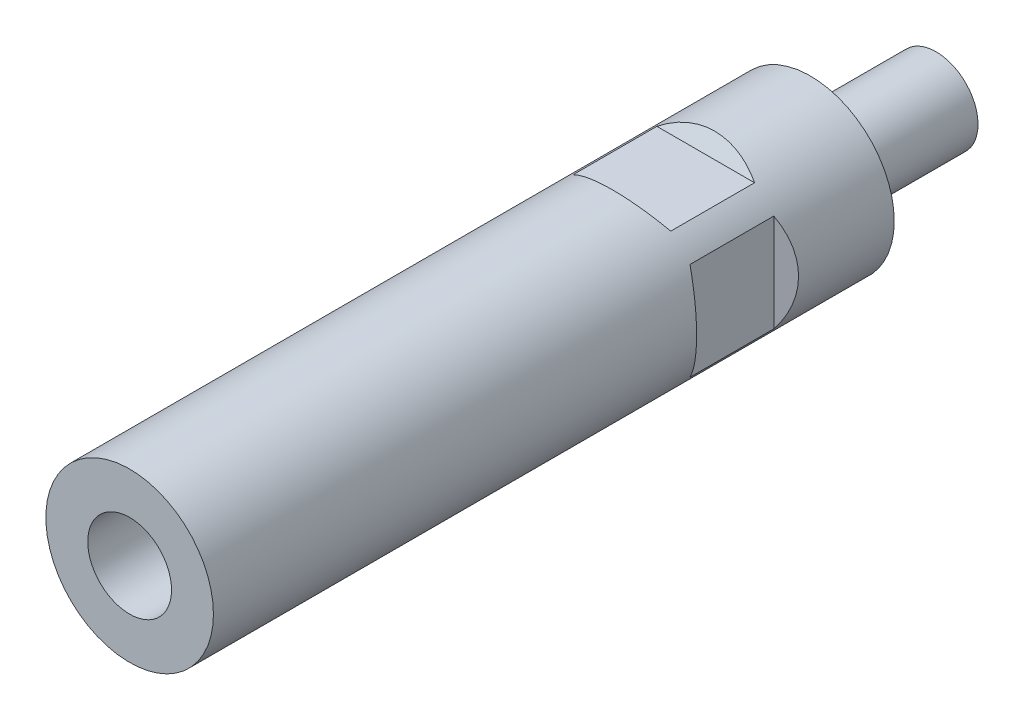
ISO-10303-21;
HEADER;
FILE_DESCRIPTION(('STEP AP214'),'2;1');
FILE_NAME('part.step','',(''),(''),'','','');
FILE_SCHEMA(('AUTOMOTIVE_DESIGN { 1 0 10303 214 1 1 1 1 }'));
ENDSEC;
DATA;
#1=APPLICATION_CONTEXT('core data for automotive mechanical design processes');
#2=APPLICATION_PROTOCOL_DEFINITION('international standard','automotive_design',2000,#1);
#3=PRODUCT_CONTEXT('',#1,'mechanical');
#4=PRODUCT('Part','Part','',(#3));
#5=PRODUCT_RELATED_PRODUCT_CATEGORY('part','',(#4));
#6=PRODUCT_DEFINITION_FORMATION('','',#4);
#7=PRODUCT_DEFINITION_CONTEXT('part definition',#1,'design');
#8=PRODUCT_DEFINITION('design','',#6,#7);
#9=PRODUCT_DEFINITION_SHAPE('','',#8);
#10=(LENGTH_UNIT() NAMED_UNIT(*) SI_UNIT(.MILLI.,.METRE.));
#11=(NAMED_UNIT(*) PLANE_ANGLE_UNIT() SI_UNIT($,.RADIAN.));
#12=(NAMED_UNIT(*) SI_UNIT($,.STERADIAN.) SOLID_ANGLE_UNIT());
#13=UNCERTAINTY_MEASURE_WITH_UNIT(LENGTH_MEASURE(1.E-05),#10,'distance_accuracy_value','');
#14=(GEOMETRIC_REPRESENTATION_CONTEXT(3) GLOBAL_UNCERTAINTY_ASSIGNED_CONTEXT((#13)) GLOBAL_UNIT_ASSIGNED_CONTEXT((#10,
#11,#12)) REPRESENTATION_CONTEXT('',''));
#15=CARTESIAN_POINT('',(0.,0.,0.));
#16=DIRECTION('',(0.,0.,1.));
#17=DIRECTION('',(1.,0.,0.));
#18=AXIS2_PLACEMENT_3D('',#15,#16,#17);
#19=CARTESIAN_POINT('',(0.,0.,8.));
#20=DIRECTION('',(0.,0.,1.));
#21=DIRECTION('',(0.,-1.,0.));
#22=AXIS2_PLACEMENT_3D('',#19,#20,#21);
#23=CYLINDRICAL_SURFACE('',#22,4.);
#24=CARTESIAN_POINT('',(0.,0.,-12.));
#25=DIRECTION('',(0.,0.,1.));
#26=DIRECTION('',(0.,-1.,0.));
#27=AXIS2_PLACEMENT_3D('',#24,#25,#26);
#28=CIRCLE('',#27,4.);
#29=CARTESIAN_POINT('',(0.,-4.,-12.));
#30=VERTEX_POINT('',#29);
#31=EDGE_CURVE('E22',#30,#30,#28,.F.);
#32=ORIENTED_EDGE('',*,*,#31,.F.);
#33=EDGE_LOOP('',(#32));
#34=FACE_BOUND('',#33,.T.);
#35=CARTESIAN_POINT('',(0.,0.,0.));
#36=DIRECTION('',(0.,0.,1.));
#37=DIRECTION('',(1.,0.,0.));
#38=AXIS2_PLACEMENT_3D('',#35,#36,#37);
#39=CIRCLE('',#38,4.);
#40=CARTESIAN_POINT('',(4.,0.,0.));
#41=VERTEX_POINT('',#40);
#42=EDGE_CURVE('E9',#41,#41,#39,.T.);
#43=ORIENTED_EDGE('',*,*,#42,.F.);
#44=EDGE_LOOP('',(#43));
#45=FACE_BOUND('',#44,.T.);
#46=ADVANCED_FACE('F14',(#34,#45),#23,.T.);
#47=CARTESIAN_POINT('',(0.,0.,-12.));
#48=DIRECTION('',(0.,0.,1.));
#49=DIRECTION('',(0.,-1.,0.));
#50=AXIS2_PLACEMENT_3D('',#47,#48,#49);
#51=PLANE('',#50);
#52=ORIENTED_EDGE('',*,*,#31,.T.);
#53=EDGE_LOOP('',(#52));
#54=FACE_BOUND('',#53,.T.);
#55=ADVANCED_FACE('F16',(#54),#51,.F.);
#56=CARTESIAN_POINT('',(3.4,0.,45.));
#57=DIRECTION('',(0.,0.,-1.));
#58=DIRECTION('',(-1.,0.,0.));
#59=AXIS2_PLACEMENT_3D('',#56,#57,#58);
#60=PLANE('',#59);
#61=CARTESIAN_POINT('',(0.,0.,45.));
#62=DIRECTION('',(0.,0.,1.));
#63=DIRECTION('',(1.,0.,0.));
#64=AXIS2_PLACEMENT_3D('',#61,#62,#63);
#65=CIRCLE('',#64,4.);
#66=CARTESIAN_POINT('',(4.,0.,45.));
#67=VERTEX_POINT('',#66);
#68=EDGE_CURVE('E251',#67,#67,#65,.T.);
#69=ORIENTED_EDGE('',*,*,#68,.T.);
#70=EDGE_LOOP('',(#69));
#71=FACE_BOUND('',#70,.T.);
#72=ADVANCED_FACE('F125',(#71),#60,.F.);
#73=CARTESIAN_POINT('',(0.,0.,65.));
#74=DIRECTION('',(0.,0.,1.));
#75=DIRECTION('',(1.,0.,0.));
#76=AXIS2_PLACEMENT_3D('',#73,#74,#75);
#77=CYLINDRICAL_SURFACE('',#76,4.);
#78=ORIENTED_EDGE('',*,*,#68,.F.);
#79=EDGE_LOOP('',(#78));
#80=FACE_BOUND('',#79,.T.);
#81=CARTESIAN_POINT('',(0.,0.,65.));
#82=DIRECTION('',(0.,0.,1.));
#83=DIRECTION('',(1.,0.,0.));
#84=AXIS2_PLACEMENT_3D('',#81,#82,#83);
#85=CIRCLE('',#84,4.);
#86=CARTESIAN_POINT('',(4.,0.,65.));
#87=VERTEX_POINT('',#86);
#88=EDGE_CURVE('E96',#87,#87,#85,.T.);
#89=ORIENTED_EDGE('',*,*,#88,.T.);
#90=EDGE_LOOP('',(#89));
#91=FACE_BOUND('',#90,.T.);
#92=ADVANCED_FACE('F127',(#80,#91),#77,.F.);
#93=CARTESIAN_POINT('',(0.,0.,65.));
#94=DIRECTION('',(0.,0.,1.));
#95=DIRECTION('',(1.,0.,0.));
#96=AXIS2_PLACEMENT_3D('',#93,#94,#95);
#97=PLANE('',#96);
#98=ORIENTED_EDGE('',*,*,#88,.F.);
#99=EDGE_LOOP('',(#98));
#100=FACE_BOUND('',#99,.T.);
#101=CARTESIAN_POINT('',(0.,0.,65.));
#102=DIRECTION('',(0.,0.,1.));
#103=DIRECTION('',(1.,0.,0.));
#104=AXIS2_PLACEMENT_3D('',#101,#102,#103);
#105=CIRCLE('',#104,8.);
#106=CARTESIAN_POINT('',(8.,0.,65.));
#107=VERTEX_POINT('',#106);
#108=EDGE_CURVE('E239',#107,#107,#105,.T.);
#109=ORIENTED_EDGE('',*,*,#108,.T.);
#110=EDGE_LOOP('',(#109));
#111=FACE_BOUND('',#110,.T.);
#112=ADVANCED_FACE('F134',(#100,#111),#97,.T.);
#113=CARTESIAN_POINT('',(6.5,-8.,18.));
#114=DIRECTION('',(-0.5,0.,0.86602540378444));
#115=DIRECTION('',(0.86602540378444,0.,0.5));
#116=AXIS2_PLACEMENT_3D('',#113,#114,#115);
#117=PLANE('',#116);
#118=DIRECTION('',(0.,1.,0.));
#119=VECTOR('',#118,1.);
#120=CARTESIAN_POINT('',(6.5,-8.,18.));
#121=LINE('',#120,#119);
#122=CARTESIAN_POINT('',(6.5,-4.6636895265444,18.));
#123=VERTEX_POINT('',#122);
#124=CARTESIAN_POINT('',(6.5,4.6636895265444,18.));
#125=VERTEX_POINT('',#124);
#126=EDGE_CURVE('E183',#123,#125,#121,.T.);
#127=ORIENTED_EDGE('',*,*,#126,.T.);
#128=CARTESIAN_POINT('',(0.,0.,14.2472232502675));
#129=DIRECTION('',(-0.5,0.,0.86602540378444));
#130=DIRECTION('',(-0.86602540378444,0.,-0.5));
#131=AXIS2_PLACEMENT_3D('',#128,#129,#130);
#132=ELLIPSE('',#131,9.237604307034,8.);
#133=EDGE_CURVE('E35',#123,#125,#132,.T.);
#134=ORIENTED_EDGE('',*,*,#133,.F.);
#135=EDGE_LOOP('',(#127,#134));
#136=FACE_BOUND('',#135,.T.);
#137=ADVANCED_FACE('F175',(#136),#117,.F.);
#138=CARTESIAN_POINT('',(6.5,-8.,18.));
#139=DIRECTION('',(-1.,0.,0.));
#140=DIRECTION('',(0.,0.,1.));
#141=AXIS2_PLACEMENT_3D('',#138,#139,#140);
#142=PLANE('',#141);
#143=ORIENTED_EDGE('',*,*,#126,.F.);
#144=DIRECTION('',(0.,0.,-1.));
#145=VECTOR('',#144,1.);
#146=CARTESIAN_POINT('',(6.5,-4.6636895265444,65.));
#147=LINE('',#146,#145);
#148=CARTESIAN_POINT('',(6.5,-4.66368952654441,10.));
#149=VERTEX_POINT('',#148);
#150=EDGE_CURVE('E191',#149,#123,#147,.F.);
#151=ORIENTED_EDGE('',*,*,#150,.F.);
#152=DIRECTION('',(0.,1.,0.));
#153=VECTOR('',#152,1.);
#154=CARTESIAN_POINT('',(6.5,-8.,10.));
#155=LINE('',#154,#153);
#156=CARTESIAN_POINT('',(6.5,4.6636895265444,10.));
#157=VERTEX_POINT('',#156);
#158=EDGE_CURVE('E187',#149,#157,#155,.T.);
#159=ORIENTED_EDGE('',*,*,#158,.T.);
#160=DIRECTION('',(0.,0.,-1.));
#161=VECTOR('',#160,1.);
#162=CARTESIAN_POINT('',(6.5,4.6636895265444,65.));
#163=LINE('',#162,#161);
#164=EDGE_CURVE('E29',#125,#157,#163,.T.);
#165=ORIENTED_EDGE('',*,*,#164,.F.);
#166=EDGE_LOOP('',(#143,#151,#159,#165));
#167=FACE_BOUND('',#166,.T.);
#168=ADVANCED_FACE('F172',(#167),#142,.F.);
#169=CARTESIAN_POINT('',(6.5,-8.,10.));
#170=DIRECTION('',(-0.5,0.,-0.866025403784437));
#171=DIRECTION('',(-0.866025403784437,0.,0.5));
#172=AXIS2_PLACEMENT_3D('',#169,#170,#171);
#173=PLANE('',#172);
#174=CARTESIAN_POINT('',(0.,0.,13.7527767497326));
#175=DIRECTION('',(-0.5,0.,-0.866025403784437));
#176=DIRECTION('',(0.866025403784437,0.,-0.5));
#177=AXIS2_PLACEMENT_3D('',#174,#175,#176);
#178=ELLIPSE('',#177,9.23760430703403,8.);
#179=EDGE_CURVE('E195',#157,#149,#178,.T.);
#180=ORIENTED_EDGE('',*,*,#179,.F.);
#181=ORIENTED_EDGE('',*,*,#158,.F.);
#182=EDGE_LOOP('',(#180,#181));
#183=FACE_BOUND('',#182,.T.);
#184=ADVANCED_FACE('F167',(#183),#173,.F.);
#185=CARTESIAN_POINT('',(-6.5,-8.,10.));
#186=DIRECTION('',(0.5,0.,-0.866025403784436));
#187=DIRECTION('',(-0.866025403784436,0.,-0.5));
#188=AXIS2_PLACEMENT_3D('',#185,#186,#187);
#189=PLANE('',#188);
#190=CARTESIAN_POINT('',(0.,0.,13.7527767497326));
#191=DIRECTION('',(0.5,0.,-0.866025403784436));
#192=DIRECTION('',(-0.866025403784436,0.,-0.5));
#193=AXIS2_PLACEMENT_3D('',#190,#191,#192);
#194=ELLIPSE('',#193,9.23760430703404,8.);
#195=CARTESIAN_POINT('',(-6.5,-4.66368952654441,10.));
#196=VERTEX_POINT('',#195);
#197=CARTESIAN_POINT('',(-6.5,4.6636895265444,10.));
#198=VERTEX_POINT('',#197);
#199=EDGE_CURVE('E193',#196,#198,#194,.T.);
#200=ORIENTED_EDGE('',*,*,#199,.F.);
#201=DIRECTION('',(0.,1.,0.));
#202=VECTOR('',#201,1.);
#203=CARTESIAN_POINT('',(-6.5,-8.,10.));
#204=LINE('',#203,#202);
#205=EDGE_CURVE('E227',#196,#198,#204,.T.);
#206=ORIENTED_EDGE('',*,*,#205,.T.);
#207=EDGE_LOOP('',(#200,#206));
#208=FACE_BOUND('',#207,.T.);
#209=ADVANCED_FACE('F163',(#208),#189,.F.);
#210=CARTESIAN_POINT('',(-6.5,-8.,18.));
#211=DIRECTION('',(0.5,0.,0.866025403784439));
#212=DIRECTION('',(0.866025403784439,0.,-0.5));
#213=AXIS2_PLACEMENT_3D('',#210,#211,#212);
#214=PLANE('',#213);
#215=DIRECTION('',(0.,1.,0.));
#216=VECTOR('',#215,1.);
#217=CARTESIAN_POINT('',(-6.5,-8.,18.));
#218=LINE('',#217,#216);
#219=CARTESIAN_POINT('',(-6.5,-4.66368952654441,18.));
#220=VERTEX_POINT('',#219);
#221=CARTESIAN_POINT('',(-6.5,4.66368952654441,18.));
#222=VERTEX_POINT('',#221);
#223=EDGE_CURVE('E231',#220,#222,#218,.T.);
#224=ORIENTED_EDGE('',*,*,#223,.F.);
#225=CARTESIAN_POINT('',(0.,0.,14.2472232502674));
#226=DIRECTION('',(0.5,0.,0.866025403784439));
#227=DIRECTION('',(0.866025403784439,0.,-0.5));
#228=AXIS2_PLACEMENT_3D('',#225,#226,#227);
#229=ELLIPSE('',#228,9.23760430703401,8.);
#230=EDGE_CURVE('E206',#222,#220,#229,.T.);
#231=ORIENTED_EDGE('',*,*,#230,.F.);
#232=EDGE_LOOP('',(#224,#231));
#233=FACE_BOUND('',#232,.T.);
#234=ADVANCED_FACE('F160',(#233),#214,.F.);
#235=CARTESIAN_POINT('',(-6.5,-8.,18.));
#236=DIRECTION('',(1.,0.,0.));
#237=DIRECTION('',(0.,0.,-1.));
#238=AXIS2_PLACEMENT_3D('',#235,#236,#237);
#239=PLANE('',#238);
#240=ORIENTED_EDGE('',*,*,#223,.T.);
#241=DIRECTION('',(0.,0.,-1.));
#242=VECTOR('',#241,1.);
#243=CARTESIAN_POINT('',(-6.5,4.66368952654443,65.));
#244=LINE('',#243,#242);
#245=EDGE_CURVE('E200',#198,#222,#244,.F.);
#246=ORIENTED_EDGE('',*,*,#245,.F.);
#247=ORIENTED_EDGE('',*,*,#205,.F.);
#248=DIRECTION('',(0.,0.,-1.));
#249=VECTOR('',#248,1.);
#250=CARTESIAN_POINT('',(-6.5,-4.66368952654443,65.));
#251=LINE('',#250,#249);
#252=EDGE_CURVE('E203',#220,#196,#251,.T.);
#253=ORIENTED_EDGE('',*,*,#252,.F.);
#254=EDGE_LOOP('',(#240,#246,#247,#253));
#255=FACE_BOUND('',#254,.T.);
#256=ADVANCED_FACE('F158',(#255),#239,.F.);
#257=CARTESIAN_POINT('',(8.,6.5,18.));
#258=DIRECTION('',(0.,-0.5,0.86602540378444));
#259=DIRECTION('',(0.,-0.86602540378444,-0.5));
#260=AXIS2_PLACEMENT_3D('',#257,#258,#259);
#261=PLANE('',#260);
#262=DIRECTION('',(-1.,0.,0.));
#263=VECTOR('',#262,1.);
#264=CARTESIAN_POINT('',(8.,6.5,18.));
#265=LINE('',#264,#263);
#266=CARTESIAN_POINT('',(4.66368952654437,6.5,18.));
#267=VERTEX_POINT('',#266);
#268=CARTESIAN_POINT('',(-4.66368952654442,6.5,18.));
#269=VERTEX_POINT('',#268);
#270=EDGE_CURVE('E225',#267,#269,#265,.T.);
#271=ORIENTED_EDGE('',*,*,#270,.T.);
#272=CARTESIAN_POINT('',(0.,0.,14.2472232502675));
#273=DIRECTION('',(0.,-0.5,0.86602540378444));
#274=DIRECTION('',(0.,-0.86602540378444,-0.5));
#275=AXIS2_PLACEMENT_3D('',#272,#273,#274);
#276=ELLIPSE('',#275,9.237604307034,8.);
#277=EDGE_CURVE('E214',#267,#269,#276,.T.);
#278=ORIENTED_EDGE('',*,*,#277,.F.);
#279=EDGE_LOOP('',(#271,#278));
#280=FACE_BOUND('',#279,.T.);
#281=ADVANCED_FACE('F151',(#280),#261,.F.);
#282=CARTESIAN_POINT('',(8.,6.5,18.));
#283=DIRECTION('',(0.,-1.,0.));
#284=DIRECTION('',(1.,0.,0.));
#285=AXIS2_PLACEMENT_3D('',#282,#283,#284);
#286=PLANE('',#285);
#287=ORIENTED_EDGE('',*,*,#270,.F.);
#288=DIRECTION('',(0.,0.,-1.));
#289=VECTOR('',#288,1.);
#290=CARTESIAN_POINT('',(4.66368952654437,6.5,65.));
#291=LINE('',#290,#289);
#292=CARTESIAN_POINT('',(4.66368952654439,6.5,10.));
#293=VERTEX_POINT('',#292);
#294=EDGE_CURVE('E88',#293,#267,#291,.F.);
#295=ORIENTED_EDGE('',*,*,#294,.F.);
#296=DIRECTION('',(-1.,0.,0.));
#297=VECTOR('',#296,1.);
#298=CARTESIAN_POINT('',(8.,6.5,10.));
#299=LINE('',#298,#297);
#300=CARTESIAN_POINT('',(-4.66368952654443,6.5,10.));
#301=VERTEX_POINT('',#300);
#302=EDGE_CURVE('E223',#293,#301,#299,.T.);
#303=ORIENTED_EDGE('',*,*,#302,.T.);
#304=DIRECTION('',(0.,0.,-1.));
#305=VECTOR('',#304,1.);
#306=CARTESIAN_POINT('',(-4.66368952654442,6.5,65.));
#307=LINE('',#306,#305);
#308=EDGE_CURVE('E211',#269,#301,#307,.T.);
#309=ORIENTED_EDGE('',*,*,#308,.F.);
#310=EDGE_LOOP('',(#287,#295,#303,#309));
#311=FACE_BOUND('',#310,.T.);
#312=ADVANCED_FACE('F148',(#311),#286,.F.);
#313=CARTESIAN_POINT('',(8.,6.5,10.));
#314=DIRECTION('',(0.,-0.5,-0.866025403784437));
#315=DIRECTION('',(0.,0.866025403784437,-0.5));
#316=AXIS2_PLACEMENT_3D('',#313,#314,#315);
#317=PLANE('',#316);
#318=CARTESIAN_POINT('',(0.,0.,13.7527767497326));
#319=DIRECTION('',(0.,-0.5,-0.866025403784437));
#320=DIRECTION('',(0.,0.866025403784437,-0.5));
#321=AXIS2_PLACEMENT_3D('',#318,#319,#320);
#322=ELLIPSE('',#321,9.23760430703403,8.);
#323=EDGE_CURVE('E209',#301,#293,#322,.T.);
#324=ORIENTED_EDGE('',*,*,#323,.F.);
#325=ORIENTED_EDGE('',*,*,#302,.F.);
#326=EDGE_LOOP('',(#324,#325));
#327=FACE_BOUND('',#326,.T.);
#328=ADVANCED_FACE('F145',(#327),#317,.F.);
#329=CARTESIAN_POINT('',(8.,-6.5,10.));
#330=DIRECTION('',(0.,0.5,-0.866025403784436));
#331=DIRECTION('',(0.,0.866025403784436,0.5));
#332=AXIS2_PLACEMENT_3D('',#329,#330,#331);
#333=PLANE('',#332);
#334=CARTESIAN_POINT('',(0.,0.,13.7527767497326));
#335=DIRECTION('',(0.,0.5,-0.866025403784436));
#336=DIRECTION('',(0.,-0.866025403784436,-0.5));
#337=AXIS2_PLACEMENT_3D('',#334,#335,#336);
#338=ELLIPSE('',#337,9.23760430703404,8.);
#339=CARTESIAN_POINT('',(4.66368952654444,-6.5,10.));
#340=VERTEX_POINT('',#339);
#341=CARTESIAN_POINT('',(-4.66368952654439,-6.5,10.));
#342=VERTEX_POINT('',#341);
#343=EDGE_CURVE('E79',#340,#342,#338,.T.);
#344=ORIENTED_EDGE('',*,*,#343,.F.);
#345=DIRECTION('',(-1.,0.,0.));
#346=VECTOR('',#345,1.);
#347=CARTESIAN_POINT('',(8.,-6.5,10.));
#348=LINE('',#347,#346);
#349=EDGE_CURVE('E82',#340,#342,#348,.T.);
#350=ORIENTED_EDGE('',*,*,#349,.T.);
#351=EDGE_LOOP('',(#344,#350));
#352=FACE_BOUND('',#351,.T.);
#353=ADVANCED_FACE('F81',(#352),#333,.F.);
#354=CARTESIAN_POINT('',(8.,-6.5,18.));
#355=DIRECTION('',(0.,0.5,0.866025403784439));
#356=DIRECTION('',(0.,-0.866025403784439,0.5));
#357=AXIS2_PLACEMENT_3D('',#354,#355,#356);
#358=PLANE('',#357);
#359=DIRECTION('',(-1.,0.,0.));
#360=VECTOR('',#359,1.);
#361=CARTESIAN_POINT('',(8.,-6.5,18.));
#362=LINE('',#361,#360);
#363=CARTESIAN_POINT('',(4.66368952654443,-6.5,18.));
#364=VERTEX_POINT('',#363);
#365=CARTESIAN_POINT('',(-4.66368952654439,-6.5,18.));
#366=VERTEX_POINT('',#365);
#367=EDGE_CURVE('E95',#364,#366,#362,.T.);
#368=ORIENTED_EDGE('',*,*,#367,.F.);
#369=CARTESIAN_POINT('',(0.,0.,14.2472232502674));
#370=DIRECTION('',(0.,0.5,0.866025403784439));
#371=DIRECTION('',(0.,0.866025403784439,-0.5));
#372=AXIS2_PLACEMENT_3D('',#369,#370,#371);
#373=ELLIPSE('',#372,9.23760430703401,8.);
#374=EDGE_CURVE('E101',#366,#364,#373,.T.);
#375=ORIENTED_EDGE('',*,*,#374,.F.);
#376=EDGE_LOOP('',(#368,#375));
#377=FACE_BOUND('',#376,.T.);
#378=ADVANCED_FACE('F139',(#377),#358,.F.);
#379=CARTESIAN_POINT('',(8.,-6.5,18.));
#380=DIRECTION('',(0.,1.,0.));
#381=DIRECTION('',(-1.,0.,0.));
#382=AXIS2_PLACEMENT_3D('',#379,#380,#381);
#383=PLANE('',#382);
#384=ORIENTED_EDGE('',*,*,#367,.T.);
#385=DIRECTION('',(0.,0.,-1.));
#386=VECTOR('',#385,1.);
#387=CARTESIAN_POINT('',(-4.66368952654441,-6.5,65.));
#388=LINE('',#387,#386);
#389=EDGE_CURVE('E87',#342,#366,#388,.F.);
#390=ORIENTED_EDGE('',*,*,#389,.F.);
#391=ORIENTED_EDGE('',*,*,#349,.F.);
#392=DIRECTION('',(0.,0.,-1.));
#393=VECTOR('',#392,1.);
#394=CARTESIAN_POINT('',(4.66368952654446,-6.5,65.));
#395=LINE('',#394,#393);
#396=EDGE_CURVE('E93',#364,#340,#395,.T.);
#397=ORIENTED_EDGE('',*,*,#396,.F.);
#398=EDGE_LOOP('',(#384,#390,#391,#397));
#399=FACE_BOUND('',#398,.T.);
#400=ADVANCED_FACE('F92',(#399),#383,.F.);
#401=CARTESIAN_POINT('',(0.,0.,65.));
#402=DIRECTION('',(0.,0.,-1.));
#403=DIRECTION('',(-1.,0.,0.));
#404=AXIS2_PLACEMENT_3D('',#401,#402,#403);
#405=CYLINDRICAL_SURFACE('',#404,8.);
#406=ORIENTED_EDGE('',*,*,#389,.T.);
#407=ORIENTED_EDGE('',*,*,#374,.T.);
#408=ORIENTED_EDGE('',*,*,#396,.T.);
#409=ORIENTED_EDGE('',*,*,#343,.T.);
#410=EDGE_LOOP('',(#406,#407,#408,#409));
#411=FACE_BOUND('',#410,.T.);
#412=ORIENTED_EDGE('',*,*,#323,.T.);
#413=ORIENTED_EDGE('',*,*,#294,.T.);
#414=ORIENTED_EDGE('',*,*,#277,.T.);
#415=ORIENTED_EDGE('',*,*,#308,.T.);
#416=EDGE_LOOP('',(#412,#413,#414,#415));
#417=FACE_BOUND('',#416,.T.);
#418=ORIENTED_EDGE('',*,*,#245,.T.);
#419=ORIENTED_EDGE('',*,*,#230,.T.);
#420=ORIENTED_EDGE('',*,*,#252,.T.);
#421=ORIENTED_EDGE('',*,*,#199,.T.);
#422=EDGE_LOOP('',(#418,#419,#420,#421));
#423=FACE_BOUND('',#422,.T.);
#424=ORIENTED_EDGE('',*,*,#179,.T.);
#425=ORIENTED_EDGE('',*,*,#150,.T.);
#426=ORIENTED_EDGE('',*,*,#133,.T.);
#427=ORIENTED_EDGE('',*,*,#164,.T.);
#428=EDGE_LOOP('',(#424,#425,#426,#427));
#429=FACE_BOUND('',#428,.T.);
#430=ORIENTED_EDGE('',*,*,#108,.F.);
#431=EDGE_LOOP('',(#430));
#432=FACE_BOUND('',#431,.T.);
#433=CARTESIAN_POINT('',(0.,0.,0.));
#434=DIRECTION('',(0.,0.,1.));
#435=DIRECTION('',(1.,0.,0.));
#436=AXIS2_PLACEMENT_3D('',#433,#434,#435);
#437=CIRCLE('',#436,8.);
#438=CARTESIAN_POINT('',(8.,0.,0.));
#439=VERTEX_POINT('',#438);
#440=EDGE_CURVE('E186',#439,#439,#437,.T.);
#441=ORIENTED_EDGE('',*,*,#440,.T.);
#442=EDGE_LOOP('',(#441));
#443=FACE_BOUND('',#442,.T.);
#444=ADVANCED_FACE('F99',(#411,#417,#423,#429,#432,#443),#405,.T.);
#445=CARTESIAN_POINT('',(0.,0.,0.));
#446=DIRECTION('',(0.,0.,1.));
#447=DIRECTION('',(1.,0.,0.));
#448=AXIS2_PLACEMENT_3D('',#445,#446,#447);
#449=PLANE('',#448);
#450=ORIENTED_EDGE('',*,*,#440,.F.);
#451=EDGE_LOOP('',(#450));
#452=FACE_BOUND('',#451,.T.);
#453=ORIENTED_EDGE('',*,*,#42,.T.);
#454=EDGE_LOOP('',(#453));
#455=FACE_BOUND('',#454,.T.);
#456=ADVANCED_FACE('F111',(#452,#455),#449,.F.);
#457=CLOSED_SHELL('',(#46,#55,#72,#92,#112,#137,#168,#184,#209,#234,#256,#281,#312,#328,#353,
#378,#400,#444,#456));
#458=MANIFOLD_SOLID_BREP('B1',#457);
#459=ADVANCED_BREP_SHAPE_REPRESENTATION('',(#18,#458),#14);
#460=SHAPE_DEFINITION_REPRESENTATION(#9,#459);
ENDSEC;
END-ISO-10303-21;
